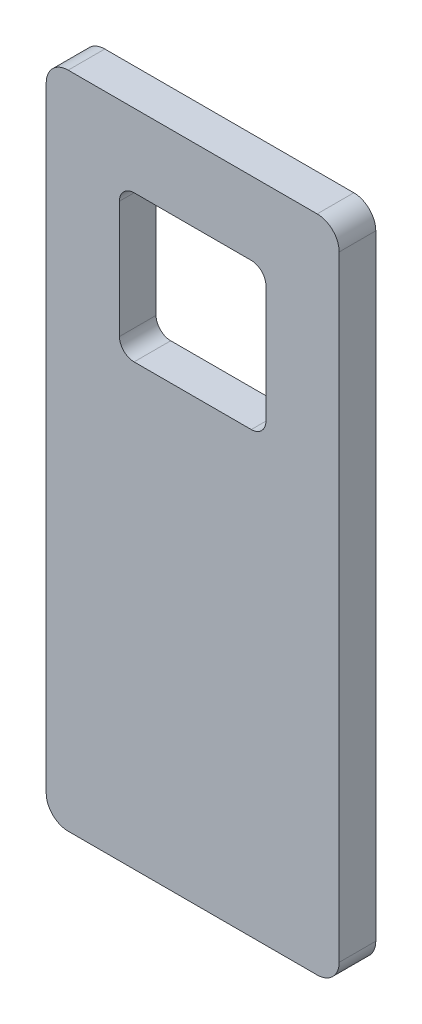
ISO-10303-21;
HEADER;
FILE_DESCRIPTION(('STEP AP214'),'2;1');
FILE_NAME('part.step','',(''),(''),'','','');
FILE_SCHEMA(('AUTOMOTIVE_DESIGN { 1 0 10303 214 1 1 1 1 }'));
ENDSEC;
DATA;
#1=APPLICATION_CONTEXT('core data for automotive mechanical design processes');
#2=APPLICATION_PROTOCOL_DEFINITION('international standard','automotive_design',2000,#1);
#3=PRODUCT_CONTEXT('',#1,'mechanical');
#4=PRODUCT('Part','Part','',(#3));
#5=PRODUCT_RELATED_PRODUCT_CATEGORY('part','',(#4));
#6=PRODUCT_DEFINITION_FORMATION('','',#4);
#7=PRODUCT_DEFINITION_CONTEXT('part definition',#1,'design');
#8=PRODUCT_DEFINITION('design','',#6,#7);
#9=PRODUCT_DEFINITION_SHAPE('','',#8);
#10=(LENGTH_UNIT() NAMED_UNIT(*) SI_UNIT(.MILLI.,.METRE.));
#11=(NAMED_UNIT(*) PLANE_ANGLE_UNIT() SI_UNIT($,.RADIAN.));
#12=(NAMED_UNIT(*) SI_UNIT($,.STERADIAN.) SOLID_ANGLE_UNIT());
#13=UNCERTAINTY_MEASURE_WITH_UNIT(LENGTH_MEASURE(1.E-05),#10,'distance_accuracy_value','');
#14=(GEOMETRIC_REPRESENTATION_CONTEXT(3) GLOBAL_UNCERTAINTY_ASSIGNED_CONTEXT((#13)) GLOBAL_UNIT_ASSIGNED_CONTEXT((#10,
#11,#12)) REPRESENTATION_CONTEXT('',''));
#15=CARTESIAN_POINT('',(0.,0.,0.));
#16=DIRECTION('',(0.,0.,1.));
#17=DIRECTION('',(1.,0.,0.));
#18=AXIS2_PLACEMENT_3D('',#15,#16,#17);
#19=CARTESIAN_POINT('',(-20.,-45.,2.5));
#20=DIRECTION('',(1.,0.,0.));
#21=DIRECTION('',(0.,0.,-1.));
#22=AXIS2_PLACEMENT_3D('',#19,#20,#21);
#23=PLANE('',#22);
#24=DIRECTION('',(0.,-1.,0.));
#25=VECTOR('',#24,1.);
#26=CARTESIAN_POINT('',(-20.,-45.,-2.5));
#27=LINE('',#26,#25);
#28=CARTESIAN_POINT('',(-20.,42.,-2.5));
#29=VERTEX_POINT('',#28);
#30=CARTESIAN_POINT('',(-20.,-42.,-2.5));
#31=VERTEX_POINT('',#30);
#32=EDGE_CURVE('E174',#29,#31,#27,.T.);
#33=ORIENTED_EDGE('',*,*,#32,.T.);
#34=DIRECTION('',(0.,0.,-1.));
#35=VECTOR('',#34,1.);
#36=CARTESIAN_POINT('',(-20.,-42.,2.5));
#37=LINE('',#36,#35);
#38=CARTESIAN_POINT('',(-20.,-42.,2.5));
#39=VERTEX_POINT('',#38);
#40=EDGE_CURVE('E152',#31,#39,#37,.F.);
#41=ORIENTED_EDGE('',*,*,#40,.T.);
#42=DIRECTION('',(0.,-1.,0.));
#43=VECTOR('',#42,1.);
#44=CARTESIAN_POINT('',(-20.,-45.,2.5));
#45=LINE('',#44,#43);
#46=CARTESIAN_POINT('',(-20.,42.,2.5));
#47=VERTEX_POINT('',#46);
#48=EDGE_CURVE('E185',#47,#39,#45,.T.);
#49=ORIENTED_EDGE('',*,*,#48,.F.);
#50=DIRECTION('',(0.,0.,-1.));
#51=VECTOR('',#50,1.);
#52=CARTESIAN_POINT('',(-20.,42.,2.5));
#53=LINE('',#52,#51);
#54=EDGE_CURVE('E157',#47,#29,#53,.T.);
#55=ORIENTED_EDGE('',*,*,#54,.T.);
#56=EDGE_LOOP('',(#33,#41,#49,#55));
#57=FACE_BOUND('',#56,.T.);
#58=ADVANCED_FACE('F33',(#57),#23,.F.);
#59=CARTESIAN_POINT('',(20.,-45.,2.5));
#60=DIRECTION('',(0.,1.,0.));
#61=DIRECTION('',(-1.,0.,0.));
#62=AXIS2_PLACEMENT_3D('',#59,#60,#61);
#63=PLANE('',#62);
#64=DIRECTION('',(1.,0.,0.));
#65=VECTOR('',#64,1.);
#66=CARTESIAN_POINT('',(20.,-45.,2.5));
#67=LINE('',#66,#65);
#68=CARTESIAN_POINT('',(-17.,-45.,2.5));
#69=VERTEX_POINT('',#68);
#70=CARTESIAN_POINT('',(17.,-45.,2.5));
#71=VERTEX_POINT('',#70);
#72=EDGE_CURVE('E167',#69,#71,#67,.T.);
#73=ORIENTED_EDGE('',*,*,#72,.F.);
#74=DIRECTION('',(0.,0.,-1.));
#75=VECTOR('',#74,1.);
#76=CARTESIAN_POINT('',(-17.,-45.,2.5));
#77=LINE('',#76,#75);
#78=CARTESIAN_POINT('',(-17.,-45.,-2.5));
#79=VERTEX_POINT('',#78);
#80=EDGE_CURVE('E151',#69,#79,#77,.T.);
#81=ORIENTED_EDGE('',*,*,#80,.T.);
#82=DIRECTION('',(1.,0.,0.));
#83=VECTOR('',#82,1.);
#84=CARTESIAN_POINT('',(20.,-45.,-2.5));
#85=LINE('',#84,#83);
#86=CARTESIAN_POINT('',(17.,-45.,-2.5));
#87=VERTEX_POINT('',#86);
#88=EDGE_CURVE('E164',#79,#87,#85,.T.);
#89=ORIENTED_EDGE('',*,*,#88,.T.);
#90=DIRECTION('',(0.,0.,-1.));
#91=VECTOR('',#90,1.);
#92=CARTESIAN_POINT('',(17.,-45.,2.5));
#93=LINE('',#92,#91);
#94=EDGE_CURVE('E169',#87,#71,#93,.F.);
#95=ORIENTED_EDGE('',*,*,#94,.T.);
#96=EDGE_LOOP('',(#73,#81,#89,#95));
#97=FACE_BOUND('',#96,.T.);
#98=ADVANCED_FACE('F163',(#97),#63,.F.);
#99=CARTESIAN_POINT('',(20.,-45.,2.5));
#100=DIRECTION('',(-1.,0.,0.));
#101=DIRECTION('',(0.,0.,1.));
#102=AXIS2_PLACEMENT_3D('',#99,#100,#101);
#103=PLANE('',#102);
#104=DIRECTION('',(0.,1.,0.));
#105=VECTOR('',#104,1.);
#106=CARTESIAN_POINT('',(20.,-45.,2.5));
#107=LINE('',#106,#105);
#108=CARTESIAN_POINT('',(20.,-42.,2.5));
#109=VERTEX_POINT('',#108);
#110=CARTESIAN_POINT('',(20.,42.,2.5));
#111=VERTEX_POINT('',#110);
#112=EDGE_CURVE('E281',#109,#111,#107,.T.);
#113=ORIENTED_EDGE('',*,*,#112,.F.);
#114=DIRECTION('',(0.,0.,-1.));
#115=VECTOR('',#114,1.);
#116=CARTESIAN_POINT('',(20.,-42.,2.5));
#117=LINE('',#116,#115);
#118=CARTESIAN_POINT('',(20.,-42.,-2.5));
#119=VERTEX_POINT('',#118);
#120=EDGE_CURVE('E205',#109,#119,#117,.T.);
#121=ORIENTED_EDGE('',*,*,#120,.T.);
#122=DIRECTION('',(0.,1.,0.));
#123=VECTOR('',#122,1.);
#124=CARTESIAN_POINT('',(20.,-45.,-2.5));
#125=LINE('',#124,#123);
#126=CARTESIAN_POINT('',(20.,42.,-2.5));
#127=VERTEX_POINT('',#126);
#128=EDGE_CURVE('E173',#119,#127,#125,.T.);
#129=ORIENTED_EDGE('',*,*,#128,.T.);
#130=DIRECTION('',(0.,0.,-1.));
#131=VECTOR('',#130,1.);
#132=CARTESIAN_POINT('',(20.,42.,2.5));
#133=LINE('',#132,#131);
#134=EDGE_CURVE('E203',#127,#111,#133,.F.);
#135=ORIENTED_EDGE('',*,*,#134,.T.);
#136=EDGE_LOOP('',(#113,#121,#129,#135));
#137=FACE_BOUND('',#136,.T.);
#138=ADVANCED_FACE('F302',(#137),#103,.F.);
#139=CARTESIAN_POINT('',(20.,45.,2.5));
#140=DIRECTION('',(0.,-1.,0.));
#141=DIRECTION('',(0.,0.,-1.));
#142=AXIS2_PLACEMENT_3D('',#139,#140,#141);
#143=PLANE('',#142);
#144=DIRECTION('',(-1.,0.,0.));
#145=VECTOR('',#144,1.);
#146=CARTESIAN_POINT('',(20.,45.,2.5));
#147=LINE('',#146,#145);
#148=CARTESIAN_POINT('',(17.,45.,2.5));
#149=VERTEX_POINT('',#148);
#150=CARTESIAN_POINT('',(-17.,45.,2.5));
#151=VERTEX_POINT('',#150);
#152=EDGE_CURVE('E186',#149,#151,#147,.T.);
#153=ORIENTED_EDGE('',*,*,#152,.F.);
#154=DIRECTION('',(0.,0.,-1.));
#155=VECTOR('',#154,1.);
#156=CARTESIAN_POINT('',(17.,45.,2.5));
#157=LINE('',#156,#155);
#158=CARTESIAN_POINT('',(17.,45.,-2.5));
#159=VERTEX_POINT('',#158);
#160=EDGE_CURVE('E210',#149,#159,#157,.T.);
#161=ORIENTED_EDGE('',*,*,#160,.T.);
#162=DIRECTION('',(-1.,0.,0.));
#163=VECTOR('',#162,1.);
#164=CARTESIAN_POINT('',(20.,45.,-2.5));
#165=LINE('',#164,#163);
#166=CARTESIAN_POINT('',(-17.,45.,-2.5));
#167=VERTEX_POINT('',#166);
#168=EDGE_CURVE('E177',#159,#167,#165,.T.);
#169=ORIENTED_EDGE('',*,*,#168,.T.);
#170=DIRECTION('',(0.,0.,-1.));
#171=VECTOR('',#170,1.);
#172=CARTESIAN_POINT('',(-17.,45.,2.5));
#173=LINE('',#172,#171);
#174=EDGE_CURVE('E208',#167,#151,#173,.F.);
#175=ORIENTED_EDGE('',*,*,#174,.T.);
#176=EDGE_LOOP('',(#153,#161,#169,#175));
#177=FACE_BOUND('',#176,.T.);
#178=ADVANCED_FACE('F296',(#177),#143,.F.);
#179=CARTESIAN_POINT('',(0.,0.,2.5));
#180=DIRECTION('',(0.,0.,1.));
#181=DIRECTION('',(1.,0.,0.));
#182=AXIS2_PLACEMENT_3D('',#179,#180,#181);
#183=PLANE('',#182);
#184=DIRECTION('',(0.,-1.,0.));
#185=VECTOR('',#184,1.);
#186=CARTESIAN_POINT('',(-10.,15.,2.5));
#187=LINE('',#186,#185);
#188=CARTESIAN_POINT('',(-10.,33.,2.5));
#189=VERTEX_POINT('',#188);
#190=CARTESIAN_POINT('',(-10.,17.,2.5));
#191=VERTEX_POINT('',#190);
#192=EDGE_CURVE('E247',#189,#191,#187,.T.);
#193=ORIENTED_EDGE('',*,*,#192,.F.);
#194=CARTESIAN_POINT('',(-8.,33.,2.5));
#195=DIRECTION('',(0.,0.,1.));
#196=DIRECTION('',(1.,0.,0.));
#197=AXIS2_PLACEMENT_3D('',#194,#195,#196);
#198=CIRCLE('',#197,2.);
#199=CARTESIAN_POINT('',(-8.00000000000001,35.,2.5));
#200=VERTEX_POINT('',#199);
#201=EDGE_CURVE('E240',#189,#200,#198,.F.);
#202=ORIENTED_EDGE('',*,*,#201,.T.);
#203=DIRECTION('',(-1.,0.,0.));
#204=VECTOR('',#203,1.);
#205=CARTESIAN_POINT('',(10.,35.,2.5));
#206=LINE('',#205,#204);
#207=CARTESIAN_POINT('',(8.,35.,2.5));
#208=VERTEX_POINT('',#207);
#209=EDGE_CURVE('E268',#208,#200,#206,.T.);
#210=ORIENTED_EDGE('',*,*,#209,.F.);
#211=CARTESIAN_POINT('',(8.,33.,2.5));
#212=DIRECTION('',(0.,0.,1.));
#213=DIRECTION('',(1.,0.,0.));
#214=AXIS2_PLACEMENT_3D('',#211,#212,#213);
#215=CIRCLE('',#214,2.);
#216=CARTESIAN_POINT('',(10.,33.,2.5));
#217=VERTEX_POINT('',#216);
#218=EDGE_CURVE('E236',#208,#217,#215,.F.);
#219=ORIENTED_EDGE('',*,*,#218,.T.);
#220=DIRECTION('',(0.,1.,0.));
#221=VECTOR('',#220,1.);
#222=CARTESIAN_POINT('',(10.,15.,2.5));
#223=LINE('',#222,#221);
#224=CARTESIAN_POINT('',(10.,17.,2.5));
#225=VERTEX_POINT('',#224);
#226=EDGE_CURVE('E273',#225,#217,#223,.T.);
#227=ORIENTED_EDGE('',*,*,#226,.F.);
#228=CARTESIAN_POINT('',(8.,17.,2.5));
#229=DIRECTION('',(0.,0.,1.));
#230=DIRECTION('',(1.,0.,0.));
#231=AXIS2_PLACEMENT_3D('',#228,#229,#230);
#232=CIRCLE('',#231,2.);
#233=CARTESIAN_POINT('',(8.,15.,2.5));
#234=VERTEX_POINT('',#233);
#235=EDGE_CURVE('E232',#225,#234,#232,.F.);
#236=ORIENTED_EDGE('',*,*,#235,.T.);
#237=DIRECTION('',(1.,0.,0.));
#238=VECTOR('',#237,1.);
#239=CARTESIAN_POINT('',(10.,15.,2.5));
#240=LINE('',#239,#238);
#241=CARTESIAN_POINT('',(-8.,15.,2.5));
#242=VERTEX_POINT('',#241);
#243=EDGE_CURVE('E249',#242,#234,#240,.T.);
#244=ORIENTED_EDGE('',*,*,#243,.F.);
#245=CARTESIAN_POINT('',(-8.,17.,2.5));
#246=DIRECTION('',(0.,0.,1.));
#247=DIRECTION('',(1.,0.,0.));
#248=AXIS2_PLACEMENT_3D('',#245,#246,#247);
#249=CIRCLE('',#248,2.);
#250=EDGE_CURVE('E41',#242,#191,#249,.F.);
#251=ORIENTED_EDGE('',*,*,#250,.T.);
#252=EDGE_LOOP('',(#193,#202,#210,#219,#227,#236,#244,#251));
#253=FACE_BOUND('',#252,.T.);
#254=ORIENTED_EDGE('',*,*,#48,.T.);
#255=CARTESIAN_POINT('',(-17.,-42.,2.5));
#256=DIRECTION('',(0.,0.,1.));
#257=DIRECTION('',(1.,0.,0.));
#258=AXIS2_PLACEMENT_3D('',#255,#256,#257);
#259=CIRCLE('',#258,3.);
#260=EDGE_CURVE('E201',#39,#69,#259,.T.);
#261=ORIENTED_EDGE('',*,*,#260,.T.);
#262=ORIENTED_EDGE('',*,*,#72,.T.);
#263=CARTESIAN_POINT('',(17.,-42.,2.5));
#264=DIRECTION('',(0.,0.,1.));
#265=DIRECTION('',(1.,0.,0.));
#266=AXIS2_PLACEMENT_3D('',#263,#264,#265);
#267=CIRCLE('',#266,3.);
#268=EDGE_CURVE('E199',#71,#109,#267,.T.);
#269=ORIENTED_EDGE('',*,*,#268,.T.);
#270=ORIENTED_EDGE('',*,*,#112,.T.);
#271=CARTESIAN_POINT('',(17.,42.,2.5));
#272=DIRECTION('',(0.,0.,1.));
#273=DIRECTION('',(1.,0.,0.));
#274=AXIS2_PLACEMENT_3D('',#271,#272,#273);
#275=CIRCLE('',#274,3.);
#276=EDGE_CURVE('E197',#111,#149,#275,.T.);
#277=ORIENTED_EDGE('',*,*,#276,.T.);
#278=ORIENTED_EDGE('',*,*,#152,.T.);
#279=CARTESIAN_POINT('',(-17.,42.,2.5));
#280=DIRECTION('',(0.,0.,1.));
#281=DIRECTION('',(1.,0.,0.));
#282=AXIS2_PLACEMENT_3D('',#279,#280,#281);
#283=CIRCLE('',#282,3.);
#284=EDGE_CURVE('E195',#151,#47,#283,.T.);
#285=ORIENTED_EDGE('',*,*,#284,.T.);
#286=EDGE_LOOP('',(#254,#261,#262,#269,#270,#277,#278,#285));
#287=FACE_BOUND('',#286,.T.);
#288=ADVANCED_FACE('F245',(#253,#287),#183,.T.);
#289=CARTESIAN_POINT('',(0.,0.,-2.5));
#290=DIRECTION('',(0.,0.,1.));
#291=DIRECTION('',(1.,0.,0.));
#292=AXIS2_PLACEMENT_3D('',#289,#290,#291);
#293=PLANE('',#292);
#294=DIRECTION('',(0.,1.,0.));
#295=VECTOR('',#294,1.);
#296=CARTESIAN_POINT('',(10.,15.,-2.5));
#297=LINE('',#296,#295);
#298=CARTESIAN_POINT('',(10.,17.,-2.5));
#299=VERTEX_POINT('',#298);
#300=CARTESIAN_POINT('',(10.,33.,-2.5));
#301=VERTEX_POINT('',#300);
#302=EDGE_CURVE('E265',#299,#301,#297,.T.);
#303=ORIENTED_EDGE('',*,*,#302,.T.);
#304=CARTESIAN_POINT('',(8.,33.,-2.5));
#305=DIRECTION('',(0.,0.,1.));
#306=DIRECTION('',(1.,0.,0.));
#307=AXIS2_PLACEMENT_3D('',#304,#305,#306);
#308=CIRCLE('',#307,2.);
#309=CARTESIAN_POINT('',(8.,35.,-2.5));
#310=VERTEX_POINT('',#309);
#311=EDGE_CURVE('E238',#301,#310,#308,.T.);
#312=ORIENTED_EDGE('',*,*,#311,.T.);
#313=DIRECTION('',(-1.,0.,0.));
#314=VECTOR('',#313,1.);
#315=CARTESIAN_POINT('',(10.,35.,-2.5));
#316=LINE('',#315,#314);
#317=CARTESIAN_POINT('',(-8.00000000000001,35.,-2.5));
#318=VERTEX_POINT('',#317);
#319=EDGE_CURVE('E179',#310,#318,#316,.T.);
#320=ORIENTED_EDGE('',*,*,#319,.T.);
#321=CARTESIAN_POINT('',(-8.,33.,-2.5));
#322=DIRECTION('',(0.,0.,1.));
#323=DIRECTION('',(1.,0.,0.));
#324=AXIS2_PLACEMENT_3D('',#321,#322,#323);
#325=CIRCLE('',#324,2.);
#326=CARTESIAN_POINT('',(-10.,33.,-2.5));
#327=VERTEX_POINT('',#326);
#328=EDGE_CURVE('E55',#318,#327,#325,.T.);
#329=ORIENTED_EDGE('',*,*,#328,.T.);
#330=DIRECTION('',(0.,-1.,0.));
#331=VECTOR('',#330,1.);
#332=CARTESIAN_POINT('',(-10.,15.,-2.5));
#333=LINE('',#332,#331);
#334=CARTESIAN_POINT('',(-10.,17.,-2.5));
#335=VERTEX_POINT('',#334);
#336=EDGE_CURVE('E261',#327,#335,#333,.T.);
#337=ORIENTED_EDGE('',*,*,#336,.T.);
#338=CARTESIAN_POINT('',(-8.,17.,-2.5));
#339=DIRECTION('',(0.,0.,1.));
#340=DIRECTION('',(1.,0.,0.));
#341=AXIS2_PLACEMENT_3D('',#338,#339,#340);
#342=CIRCLE('',#341,2.);
#343=CARTESIAN_POINT('',(-8.,15.,-2.5));
#344=VERTEX_POINT('',#343);
#345=EDGE_CURVE('E11',#335,#344,#342,.T.);
#346=ORIENTED_EDGE('',*,*,#345,.T.);
#347=DIRECTION('',(1.,0.,0.));
#348=VECTOR('',#347,1.);
#349=CARTESIAN_POINT('',(10.,15.,-2.5));
#350=LINE('',#349,#348);
#351=CARTESIAN_POINT('',(8.,15.,-2.5));
#352=VERTEX_POINT('',#351);
#353=EDGE_CURVE('E259',#344,#352,#350,.T.);
#354=ORIENTED_EDGE('',*,*,#353,.T.);
#355=CARTESIAN_POINT('',(8.,17.,-2.5));
#356=DIRECTION('',(0.,0.,1.));
#357=DIRECTION('',(1.,0.,0.));
#358=AXIS2_PLACEMENT_3D('',#355,#356,#357);
#359=CIRCLE('',#358,2.);
#360=EDGE_CURVE('E234',#352,#299,#359,.T.);
#361=ORIENTED_EDGE('',*,*,#360,.T.);
#362=EDGE_LOOP('',(#303,#312,#320,#329,#337,#346,#354,#361));
#363=FACE_BOUND('',#362,.T.);
#364=ORIENTED_EDGE('',*,*,#88,.F.);
#365=CARTESIAN_POINT('',(-17.,-42.,-2.5));
#366=DIRECTION('',(0.,0.,1.));
#367=DIRECTION('',(1.,0.,0.));
#368=AXIS2_PLACEMENT_3D('',#365,#366,#367);
#369=CIRCLE('',#368,3.);
#370=EDGE_CURVE('E147',#79,#31,#369,.F.);
#371=ORIENTED_EDGE('',*,*,#370,.T.);
#372=ORIENTED_EDGE('',*,*,#32,.F.);
#373=CARTESIAN_POINT('',(-17.,42.,-2.5));
#374=DIRECTION('',(0.,0.,1.));
#375=DIRECTION('',(1.,0.,0.));
#376=AXIS2_PLACEMENT_3D('',#373,#374,#375);
#377=CIRCLE('',#376,3.);
#378=EDGE_CURVE('E168',#29,#167,#377,.F.);
#379=ORIENTED_EDGE('',*,*,#378,.T.);
#380=ORIENTED_EDGE('',*,*,#168,.F.);
#381=CARTESIAN_POINT('',(17.,42.,-2.5));
#382=DIRECTION('',(0.,0.,1.));
#383=DIRECTION('',(1.,0.,0.));
#384=AXIS2_PLACEMENT_3D('',#381,#382,#383);
#385=CIRCLE('',#384,3.);
#386=EDGE_CURVE('E189',#159,#127,#385,.F.);
#387=ORIENTED_EDGE('',*,*,#386,.T.);
#388=ORIENTED_EDGE('',*,*,#128,.F.);
#389=CARTESIAN_POINT('',(17.,-42.,-2.5));
#390=DIRECTION('',(0.,0.,1.));
#391=DIRECTION('',(1.,0.,0.));
#392=AXIS2_PLACEMENT_3D('',#389,#390,#391);
#393=CIRCLE('',#392,3.);
#394=EDGE_CURVE('E158',#119,#87,#393,.F.);
#395=ORIENTED_EDGE('',*,*,#394,.T.);
#396=EDGE_LOOP('',(#364,#371,#372,#379,#380,#387,#388,#395));
#397=FACE_BOUND('',#396,.T.);
#398=ADVANCED_FACE('F171',(#363,#397),#293,.F.);
#399=CARTESIAN_POINT('',(-17.,-42.,2.5));
#400=DIRECTION('',(0.,0.,-1.));
#401=DIRECTION('',(-1.,0.,0.));
#402=AXIS2_PLACEMENT_3D('',#399,#400,#401);
#403=CYLINDRICAL_SURFACE('',#402,3.);
#404=ORIENTED_EDGE('',*,*,#260,.F.);
#405=ORIENTED_EDGE('',*,*,#40,.F.);
#406=ORIENTED_EDGE('',*,*,#370,.F.);
#407=ORIENTED_EDGE('',*,*,#80,.F.);
#408=EDGE_LOOP('',(#404,#405,#406,#407));
#409=FACE_BOUND('',#408,.T.);
#410=ADVANCED_FACE('F150',(#409),#403,.T.);
#411=CARTESIAN_POINT('',(17.,-42.,2.5));
#412=DIRECTION('',(0.,0.,-1.));
#413=DIRECTION('',(-1.,0.,0.));
#414=AXIS2_PLACEMENT_3D('',#411,#412,#413);
#415=CYLINDRICAL_SURFACE('',#414,3.);
#416=ORIENTED_EDGE('',*,*,#268,.F.);
#417=ORIENTED_EDGE('',*,*,#94,.F.);
#418=ORIENTED_EDGE('',*,*,#394,.F.);
#419=ORIENTED_EDGE('',*,*,#120,.F.);
#420=EDGE_LOOP('',(#416,#417,#418,#419));
#421=FACE_BOUND('',#420,.T.);
#422=ADVANCED_FACE('F306',(#421),#415,.T.);
#423=CARTESIAN_POINT('',(17.,42.,2.5));
#424=DIRECTION('',(0.,0.,-1.));
#425=DIRECTION('',(-1.,0.,0.));
#426=AXIS2_PLACEMENT_3D('',#423,#424,#425);
#427=CYLINDRICAL_SURFACE('',#426,3.);
#428=ORIENTED_EDGE('',*,*,#276,.F.);
#429=ORIENTED_EDGE('',*,*,#134,.F.);
#430=ORIENTED_EDGE('',*,*,#386,.F.);
#431=ORIENTED_EDGE('',*,*,#160,.F.);
#432=EDGE_LOOP('',(#428,#429,#430,#431));
#433=FACE_BOUND('',#432,.T.);
#434=ADVANCED_FACE('F298',(#433),#427,.T.);
#435=CARTESIAN_POINT('',(-17.,42.,2.5));
#436=DIRECTION('',(0.,0.,-1.));
#437=DIRECTION('',(-1.,0.,0.));
#438=AXIS2_PLACEMENT_3D('',#435,#436,#437);
#439=CYLINDRICAL_SURFACE('',#438,3.);
#440=ORIENTED_EDGE('',*,*,#284,.F.);
#441=ORIENTED_EDGE('',*,*,#174,.F.);
#442=ORIENTED_EDGE('',*,*,#378,.F.);
#443=ORIENTED_EDGE('',*,*,#54,.F.);
#444=EDGE_LOOP('',(#440,#441,#442,#443));
#445=FACE_BOUND('',#444,.T.);
#446=ADVANCED_FACE('F293',(#445),#439,.T.);
#447=CARTESIAN_POINT('',(-10.,15.,-2.5));
#448=DIRECTION('',(-1.,0.,0.));
#449=DIRECTION('',(0.,0.,1.));
#450=AXIS2_PLACEMENT_3D('',#447,#448,#449);
#451=PLANE('',#450);
#452=ORIENTED_EDGE('',*,*,#336,.F.);
#453=DIRECTION('',(0.,0.,1.));
#454=VECTOR('',#453,1.);
#455=CARTESIAN_POINT('',(-10.,33.,2.5));
#456=LINE('',#455,#454);
#457=EDGE_CURVE('E229',#327,#189,#456,.T.);
#458=ORIENTED_EDGE('',*,*,#457,.T.);
#459=ORIENTED_EDGE('',*,*,#192,.T.);
#460=DIRECTION('',(0.,0.,1.));
#461=VECTOR('',#460,1.);
#462=CARTESIAN_POINT('',(-10.,17.,-2.5));
#463=LINE('',#462,#461);
#464=EDGE_CURVE('E48',#191,#335,#463,.F.);
#465=ORIENTED_EDGE('',*,*,#464,.T.);
#466=EDGE_LOOP('',(#452,#458,#459,#465));
#467=FACE_BOUND('',#466,.T.);
#468=ADVANCED_FACE('F252',(#467),#451,.F.);
#469=CARTESIAN_POINT('',(10.,35.,-2.5));
#470=DIRECTION('',(0.,1.,0.));
#471=DIRECTION('',(-1.,0.,0.));
#472=AXIS2_PLACEMENT_3D('',#469,#470,#471);
#473=PLANE('',#472);
#474=ORIENTED_EDGE('',*,*,#319,.F.);
#475=DIRECTION('',(0.,0.,1.));
#476=VECTOR('',#475,1.);
#477=CARTESIAN_POINT('',(8.,35.,2.5));
#478=LINE('',#477,#476);
#479=EDGE_CURVE('E225',#310,#208,#478,.T.);
#480=ORIENTED_EDGE('',*,*,#479,.T.);
#481=ORIENTED_EDGE('',*,*,#209,.T.);
#482=DIRECTION('',(0.,0.,1.));
#483=VECTOR('',#482,1.);
#484=CARTESIAN_POINT('',(-8.00000000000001,35.,-2.5));
#485=LINE('',#484,#483);
#486=EDGE_CURVE('E223',#200,#318,#485,.F.);
#487=ORIENTED_EDGE('',*,*,#486,.T.);
#488=EDGE_LOOP('',(#474,#480,#481,#487));
#489=FACE_BOUND('',#488,.T.);
#490=ADVANCED_FACE('F332',(#489),#473,.F.);
#491=CARTESIAN_POINT('',(10.,15.,-2.5));
#492=DIRECTION('',(1.,0.,0.));
#493=DIRECTION('',(0.,0.,-1.));
#494=AXIS2_PLACEMENT_3D('',#491,#492,#493);
#495=PLANE('',#494);
#496=ORIENTED_EDGE('',*,*,#302,.F.);
#497=DIRECTION('',(0.,0.,1.));
#498=VECTOR('',#497,1.);
#499=CARTESIAN_POINT('',(10.,17.,2.5));
#500=LINE('',#499,#498);
#501=EDGE_CURVE('E215',#299,#225,#500,.T.);
#502=ORIENTED_EDGE('',*,*,#501,.T.);
#503=ORIENTED_EDGE('',*,*,#226,.T.);
#504=DIRECTION('',(0.,0.,1.));
#505=VECTOR('',#504,1.);
#506=CARTESIAN_POINT('',(10.,33.,-2.5));
#507=LINE('',#506,#505);
#508=EDGE_CURVE('E213',#217,#301,#507,.F.);
#509=ORIENTED_EDGE('',*,*,#508,.T.);
#510=EDGE_LOOP('',(#496,#502,#503,#509));
#511=FACE_BOUND('',#510,.T.);
#512=ADVANCED_FACE('F336',(#511),#495,.F.);
#513=CARTESIAN_POINT('',(10.,15.,-2.5));
#514=DIRECTION('',(0.,-1.,0.));
#515=DIRECTION('',(0.,0.,-1.));
#516=AXIS2_PLACEMENT_3D('',#513,#514,#515);
#517=PLANE('',#516);
#518=ORIENTED_EDGE('',*,*,#243,.T.);
#519=DIRECTION('',(0.,0.,1.));
#520=VECTOR('',#519,1.);
#521=CARTESIAN_POINT('',(8.,15.,-2.5));
#522=LINE('',#521,#520);
#523=EDGE_CURVE('E221',#234,#352,#522,.F.);
#524=ORIENTED_EDGE('',*,*,#523,.T.);
#525=ORIENTED_EDGE('',*,*,#353,.F.);
#526=DIRECTION('',(0.,0.,1.));
#527=VECTOR('',#526,1.);
#528=CARTESIAN_POINT('',(-8.,15.,2.5));
#529=LINE('',#528,#527);
#530=EDGE_CURVE('E218',#344,#242,#529,.T.);
#531=ORIENTED_EDGE('',*,*,#530,.T.);
#532=EDGE_LOOP('',(#518,#524,#525,#531));
#533=FACE_BOUND('',#532,.T.);
#534=ADVANCED_FACE('F263',(#533),#517,.F.);
#535=CARTESIAN_POINT('',(8.,17.,-2.5));
#536=DIRECTION('',(0.,0.,-1.));
#537=DIRECTION('',(-1.,0.,0.));
#538=AXIS2_PLACEMENT_3D('',#535,#536,#537);
#539=CYLINDRICAL_SURFACE('',#538,2.);
#540=ORIENTED_EDGE('',*,*,#360,.F.);
#541=ORIENTED_EDGE('',*,*,#523,.F.);
#542=ORIENTED_EDGE('',*,*,#235,.F.);
#543=ORIENTED_EDGE('',*,*,#501,.F.);
#544=EDGE_LOOP('',(#540,#541,#542,#543));
#545=FACE_BOUND('',#544,.T.);
#546=ADVANCED_FACE('F335',(#545),#539,.F.);
#547=CARTESIAN_POINT('',(8.,33.,-2.5));
#548=DIRECTION('',(0.,0.,-1.));
#549=DIRECTION('',(-1.,0.,0.));
#550=AXIS2_PLACEMENT_3D('',#547,#548,#549);
#551=CYLINDRICAL_SURFACE('',#550,2.);
#552=ORIENTED_EDGE('',*,*,#311,.F.);
#553=ORIENTED_EDGE('',*,*,#508,.F.);
#554=ORIENTED_EDGE('',*,*,#218,.F.);
#555=ORIENTED_EDGE('',*,*,#479,.F.);
#556=EDGE_LOOP('',(#552,#553,#554,#555));
#557=FACE_BOUND('',#556,.T.);
#558=ADVANCED_FACE('F350',(#557),#551,.F.);
#559=CARTESIAN_POINT('',(-8.,33.,-2.5));
#560=DIRECTION('',(0.,0.,-1.));
#561=DIRECTION('',(-1.,0.,0.));
#562=AXIS2_PLACEMENT_3D('',#559,#560,#561);
#563=CYLINDRICAL_SURFACE('',#562,2.);
#564=ORIENTED_EDGE('',*,*,#328,.F.);
#565=ORIENTED_EDGE('',*,*,#486,.F.);
#566=ORIENTED_EDGE('',*,*,#201,.F.);
#567=ORIENTED_EDGE('',*,*,#457,.F.);
#568=EDGE_LOOP('',(#564,#565,#566,#567));
#569=FACE_BOUND('',#568,.T.);
#570=ADVANCED_FACE('F361',(#569),#563,.F.);
#571=CARTESIAN_POINT('',(-8.,17.,-2.5));
#572=DIRECTION('',(0.,0.,-1.));
#573=DIRECTION('',(-1.,0.,0.));
#574=AXIS2_PLACEMENT_3D('',#571,#572,#573);
#575=CYLINDRICAL_SURFACE('',#574,2.);
#576=ORIENTED_EDGE('',*,*,#345,.F.);
#577=ORIENTED_EDGE('',*,*,#464,.F.);
#578=ORIENTED_EDGE('',*,*,#250,.F.);
#579=ORIENTED_EDGE('',*,*,#530,.F.);
#580=EDGE_LOOP('',(#576,#577,#578,#579));
#581=FACE_BOUND('',#580,.T.);
#582=ADVANCED_FACE('F35',(#581),#575,.F.);
#583=CLOSED_SHELL('',(#58,#98,#138,#178,#288,#398,#410,#422,#434,#446,#468,#490,#512,#534,#546,
#558,#570,#582));
#584=MANIFOLD_SOLID_BREP('B2',#583);
#585=ADVANCED_BREP_SHAPE_REPRESENTATION('',(#18,#584),#14);
#586=SHAPE_DEFINITION_REPRESENTATION(#9,#585);
ENDSEC;
END-ISO-10303-21;
